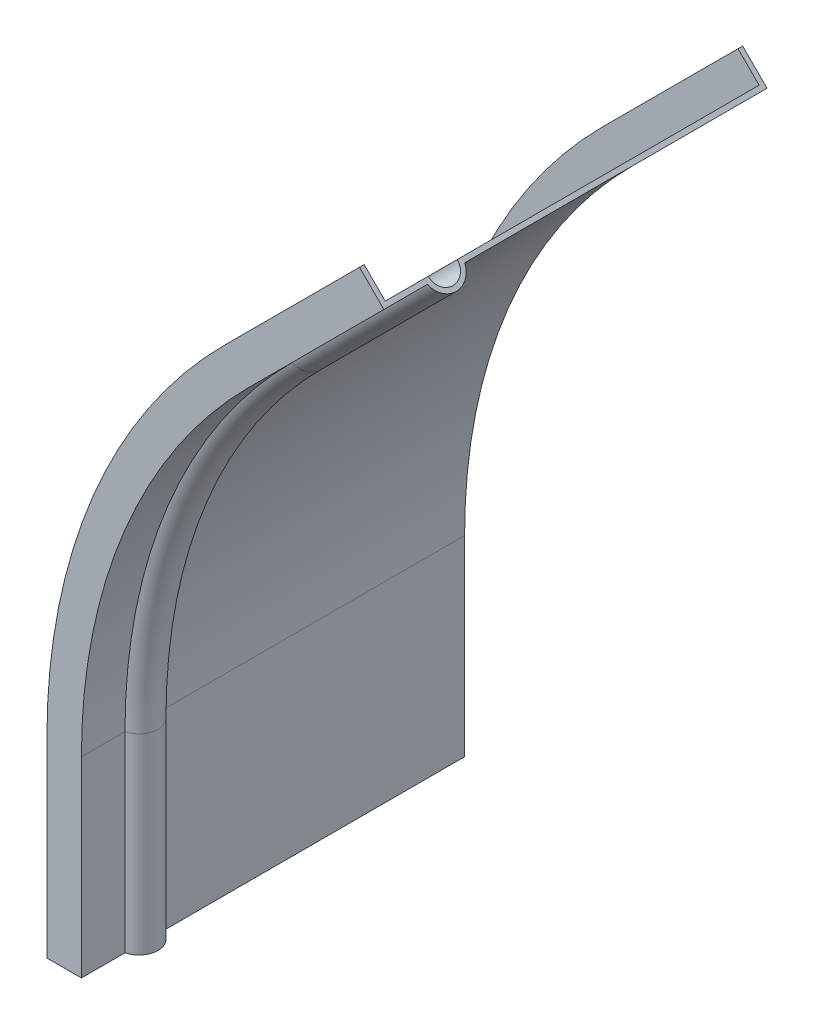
ISO-10303-21;
HEADER;
FILE_DESCRIPTION(('STEP AP214'),'2;1');
FILE_NAME('part.step','',(''),(''),'','','');
FILE_SCHEMA(('AUTOMOTIVE_DESIGN { 1 0 10303 214 1 1 1 1 }'));
ENDSEC;
DATA;
#1=APPLICATION_CONTEXT('core data for automotive mechanical design processes');
#2=APPLICATION_PROTOCOL_DEFINITION('international standard','automotive_design',2000,#1);
#3=PRODUCT_CONTEXT('',#1,'mechanical');
#4=PRODUCT('Part','Part','',(#3));
#5=PRODUCT_RELATED_PRODUCT_CATEGORY('part','',(#4));
#6=PRODUCT_DEFINITION_FORMATION('','',#4);
#7=PRODUCT_DEFINITION_CONTEXT('part definition',#1,'design');
#8=PRODUCT_DEFINITION('design','',#6,#7);
#9=PRODUCT_DEFINITION_SHAPE('','',#8);
#10=(LENGTH_UNIT() NAMED_UNIT(*) SI_UNIT(.MILLI.,.METRE.));
#11=(NAMED_UNIT(*) PLANE_ANGLE_UNIT() SI_UNIT($,.RADIAN.));
#12=(NAMED_UNIT(*) SI_UNIT($,.STERADIAN.) SOLID_ANGLE_UNIT());
#13=UNCERTAINTY_MEASURE_WITH_UNIT(LENGTH_MEASURE(1.E-05),#10,'distance_accuracy_value','');
#14=(GEOMETRIC_REPRESENTATION_CONTEXT(3) GLOBAL_UNCERTAINTY_ASSIGNED_CONTEXT((#13)) GLOBAL_UNIT_ASSIGNED_CONTEXT((#10,
#11,#12)) REPRESENTATION_CONTEXT('',''));
#15=CARTESIAN_POINT('',(0.,0.,0.));
#16=DIRECTION('',(0.,0.,1.));
#17=DIRECTION('',(1.,0.,0.));
#18=AXIS2_PLACEMENT_3D('',#15,#16,#17);
#19=CARTESIAN_POINT('',(538.428449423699,161.5715505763,0.));
#20=DIRECTION('',(-0.707106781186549,0.707106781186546,0.));
#21=DIRECTION('',(-0.707106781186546,-0.707106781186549,0.));
#22=AXIS2_PLACEMENT_3D('',#19,#20,#21);
#23=PLANE('',#22);
#24=DIRECTION('',(0.,0.,1.));
#25=VECTOR('',#24,1.);
#26=CARTESIAN_POINT('',(538.428449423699,161.5715505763,0.));
#27=LINE('',#26,#25);
#28=CARTESIAN_POINT('',(538.428449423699,161.5715505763,-1.21400000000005));
#29=VERTEX_POINT('',#28);
#30=CARTESIAN_POINT('',(538.428449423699,161.5715505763,0.));
#31=VERTEX_POINT('',#30);
#32=EDGE_CURVE('E243',#29,#31,#27,.T.);
#33=ORIENTED_EDGE('',*,*,#32,.T.);
#34=DIRECTION('',(0.707106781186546,0.707106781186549,0.));
#35=VECTOR('',#34,1.);
#36=CARTESIAN_POINT('',(538.428449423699,161.5715505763,0.));
#37=LINE('',#36,#35);
#38=CARTESIAN_POINT('',(573.783788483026,196.926889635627,0.));
#39=VERTEX_POINT('',#38);
#40=EDGE_CURVE('E333',#31,#39,#37,.T.);
#41=ORIENTED_EDGE('',*,*,#40,.T.);
#42=DIRECTION('',(0.,0.,1.));
#43=VECTOR('',#42,1.);
#44=CARTESIAN_POINT('',(573.783788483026,196.926889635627,0.));
#45=LINE('',#44,#43);
#46=CARTESIAN_POINT('',(573.783788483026,196.926889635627,-1.21400000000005));
#47=VERTEX_POINT('',#46);
#48=EDGE_CURVE('E52',#47,#39,#45,.T.);
#49=ORIENTED_EDGE('',*,*,#48,.F.);
#50=DIRECTION('',(0.707106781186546,0.707106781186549,0.));
#51=VECTOR('',#50,1.);
#52=CARTESIAN_POINT('',(538.428449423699,161.5715505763,-1.21400000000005));
#53=LINE('',#52,#51);
#54=EDGE_CURVE('E37',#29,#47,#53,.T.);
#55=ORIENTED_EDGE('',*,*,#54,.F.);
#56=EDGE_LOOP('',(#33,#41,#49,#55));
#57=FACE_BOUND('',#56,.T.);
#58=ADVANCED_FACE('F30',(#57),#23,.T.);
#59=CARTESIAN_POINT('',(543.933982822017,156.066017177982,78.786));
#60=DIRECTION('',(-0.707106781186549,0.707106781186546,0.));
#61=DIRECTION('',(-0.707106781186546,-0.707106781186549,0.));
#62=AXIS2_PLACEMENT_3D('',#59,#60,#61);
#63=PLANE('',#62);
#64=DIRECTION('',(0.,0.,1.));
#65=VECTOR('',#64,1.);
#66=CARTESIAN_POINT('',(543.933982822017,156.066017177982,78.786));
#67=LINE('',#66,#65);
#68=CARTESIAN_POINT('',(543.933982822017,156.066017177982,0.));
#69=VERTEX_POINT('',#68);
#70=CARTESIAN_POINT('',(543.933982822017,156.066017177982,78.786));
#71=VERTEX_POINT('',#70);
#72=EDGE_CURVE('E240',#69,#71,#67,.T.);
#73=ORIENTED_EDGE('',*,*,#72,.T.);
#74=DIRECTION('',(0.707106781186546,0.707106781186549,0.));
#75=VECTOR('',#74,1.);
#76=CARTESIAN_POINT('',(543.933982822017,156.066017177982,78.786));
#77=LINE('',#76,#75);
#78=CARTESIAN_POINT('',(579.289321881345,191.421356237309,78.786));
#79=VERTEX_POINT('',#78);
#80=EDGE_CURVE('E327',#71,#79,#77,.T.);
#81=ORIENTED_EDGE('',*,*,#80,.T.);
#82=DIRECTION('',(0.,0.,1.));
#83=VECTOR('',#82,1.);
#84=CARTESIAN_POINT('',(579.289321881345,191.421356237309,78.786));
#85=LINE('',#84,#83);
#86=CARTESIAN_POINT('',(579.289321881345,191.421356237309,0.));
#87=VERTEX_POINT('',#86);
#88=EDGE_CURVE('E298',#87,#79,#85,.T.);
#89=ORIENTED_EDGE('',*,*,#88,.F.);
#90=DIRECTION('',(0.707106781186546,0.707106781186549,0.));
#91=VECTOR('',#90,1.);
#92=CARTESIAN_POINT('',(543.933982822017,156.066017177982,0.));
#93=LINE('',#92,#91);
#94=EDGE_CURVE('E330',#69,#87,#93,.T.);
#95=ORIENTED_EDGE('',*,*,#94,.F.);
#96=EDGE_LOOP('',(#73,#81,#89,#95));
#97=FACE_BOUND('',#96,.T.);
#98=ADVANCED_FACE('F472',(#97),#63,.T.);
#99=CARTESIAN_POINT('',(543.933982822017,156.066017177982,82.572));
#100=DIRECTION('',(0.707106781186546,0.707106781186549,0.));
#101=DIRECTION('',(-0.707106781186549,0.707106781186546,0.));
#102=AXIS2_PLACEMENT_3D('',#99,#100,#101);
#103=CYLINDRICAL_SURFACE('',#102,3.786);
#104=CARTESIAN_POINT('',(543.933982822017,156.066017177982,82.572));
#105=DIRECTION('',(-0.707106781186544,-0.707106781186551,0.));
#106=DIRECTION('',(0.,0.,1.));
#107=AXIS2_PLACEMENT_3D('',#104,#105,#106);
#108=CIRCLE('',#107,3.786);
#109=CARTESIAN_POINT('',(543.933982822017,156.066017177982,86.358));
#110=VERTEX_POINT('',#109);
#111=EDGE_CURVE('E237',#71,#110,#108,.T.);
#112=ORIENTED_EDGE('',*,*,#111,.T.);
#113=DIRECTION('',(0.707106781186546,0.707106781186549,0.));
#114=VECTOR('',#113,1.);
#115=CARTESIAN_POINT('',(543.933982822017,156.066017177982,86.358));
#116=LINE('',#115,#114);
#117=CARTESIAN_POINT('',(579.289321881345,191.421356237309,86.358));
#118=VERTEX_POINT('',#117);
#119=EDGE_CURVE('E324',#110,#118,#116,.T.);
#120=ORIENTED_EDGE('',*,*,#119,.T.);
#121=CARTESIAN_POINT('',(579.289321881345,191.421356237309,82.572));
#122=DIRECTION('',(-0.707106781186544,-0.707106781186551,0.));
#123=DIRECTION('',(0.,0.,1.));
#124=AXIS2_PLACEMENT_3D('',#121,#122,#123);
#125=CIRCLE('',#124,3.786);
#126=EDGE_CURVE('E295',#79,#118,#125,.T.);
#127=ORIENTED_EDGE('',*,*,#126,.F.);
#128=ORIENTED_EDGE('',*,*,#80,.F.);
#129=EDGE_LOOP('',(#112,#120,#127,#128));
#130=FACE_BOUND('',#129,.T.);
#131=ADVANCED_FACE('F474',(#130),#103,.F.);
#132=CARTESIAN_POINT('',(543.933982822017,156.066017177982,97.572));
#133=DIRECTION('',(-0.707106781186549,0.707106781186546,0.));
#134=DIRECTION('',(-0.707106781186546,-0.707106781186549,0.));
#135=AXIS2_PLACEMENT_3D('',#132,#133,#134);
#136=PLANE('',#135);
#137=DIRECTION('',(0.,0.,1.));
#138=VECTOR('',#137,1.);
#139=CARTESIAN_POINT('',(543.933982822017,156.066017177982,97.572));
#140=LINE('',#139,#138);
#141=CARTESIAN_POINT('',(543.933982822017,156.066017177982,97.572));
#142=VERTEX_POINT('',#141);
#143=EDGE_CURVE('E234',#110,#142,#140,.T.);
#144=ORIENTED_EDGE('',*,*,#143,.T.);
#145=DIRECTION('',(0.707106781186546,0.707106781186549,0.));
#146=VECTOR('',#145,1.);
#147=CARTESIAN_POINT('',(543.933982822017,156.066017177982,97.572));
#148=LINE('',#147,#146);
#149=CARTESIAN_POINT('',(579.289321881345,191.421356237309,97.572));
#150=VERTEX_POINT('',#149);
#151=EDGE_CURVE('E321',#142,#150,#148,.T.);
#152=ORIENTED_EDGE('',*,*,#151,.T.);
#153=DIRECTION('',(0.,0.,1.));
#154=VECTOR('',#153,1.);
#155=CARTESIAN_POINT('',(579.289321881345,191.421356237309,97.572));
#156=LINE('',#155,#154);
#157=EDGE_CURVE('E292',#118,#150,#156,.T.);
#158=ORIENTED_EDGE('',*,*,#157,.F.);
#159=ORIENTED_EDGE('',*,*,#119,.F.);
#160=EDGE_LOOP('',(#144,#152,#158,#159));
#161=FACE_BOUND('',#160,.T.);
#162=ADVANCED_FACE('F477',(#161),#136,.T.);
#163=CARTESIAN_POINT('',(538.428449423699,161.5715505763,98.786));
#164=DIRECTION('',(-0.707106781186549,0.707106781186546,0.));
#165=DIRECTION('',(-0.707106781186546,-0.707106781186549,0.));
#166=AXIS2_PLACEMENT_3D('',#163,#164,#165);
#167=PLANE('',#166);
#168=DIRECTION('',(0.,0.,1.));
#169=VECTOR('',#168,1.);
#170=CARTESIAN_POINT('',(538.428449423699,161.5715505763,98.786));
#171=LINE('',#170,#169);
#172=CARTESIAN_POINT('',(538.428449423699,161.5715505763,97.572));
#173=VERTEX_POINT('',#172);
#174=CARTESIAN_POINT('',(538.428449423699,161.5715505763,98.786));
#175=VERTEX_POINT('',#174);
#176=EDGE_CURVE('E231',#173,#175,#171,.T.);
#177=ORIENTED_EDGE('',*,*,#176,.T.);
#178=DIRECTION('',(0.707106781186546,0.707106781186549,0.));
#179=VECTOR('',#178,1.);
#180=CARTESIAN_POINT('',(538.428449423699,161.5715505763,98.786));
#181=LINE('',#180,#179);
#182=CARTESIAN_POINT('',(573.783788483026,196.926889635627,98.786));
#183=VERTEX_POINT('',#182);
#184=EDGE_CURVE('E315',#175,#183,#181,.T.);
#185=ORIENTED_EDGE('',*,*,#184,.T.);
#186=DIRECTION('',(0.,0.,1.));
#187=VECTOR('',#186,1.);
#188=CARTESIAN_POINT('',(573.783788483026,196.926889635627,98.786));
#189=LINE('',#188,#187);
#190=CARTESIAN_POINT('',(573.783788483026,196.926889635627,97.572));
#191=VERTEX_POINT('',#190);
#192=EDGE_CURVE('E286',#191,#183,#189,.T.);
#193=ORIENTED_EDGE('',*,*,#192,.F.);
#194=DIRECTION('',(0.707106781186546,0.707106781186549,0.));
#195=VECTOR('',#194,1.);
#196=CARTESIAN_POINT('',(538.428449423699,161.5715505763,97.572));
#197=LINE('',#196,#195);
#198=EDGE_CURVE('E318',#173,#191,#197,.T.);
#199=ORIENTED_EDGE('',*,*,#198,.F.);
#200=EDGE_LOOP('',(#177,#185,#193,#199));
#201=FACE_BOUND('',#200,.T.);
#202=ADVANCED_FACE('F479',(#201),#167,.T.);
#203=CARTESIAN_POINT('',(544.792410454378,155.207589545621,87.4223818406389));
#204=DIRECTION('',(0.707106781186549,-0.707106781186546,0.));
#205=DIRECTION('',(0.707106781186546,0.707106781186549,0.));
#206=AXIS2_PLACEMENT_3D('',#203,#204,#205);
#207=PLANE('',#206);
#208=DIRECTION('',(0.,0.,-1.));
#209=VECTOR('',#208,1.);
#210=CARTESIAN_POINT('',(544.792410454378,155.207589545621,87.4223818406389));
#211=LINE('',#210,#209);
#212=CARTESIAN_POINT('',(544.792410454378,155.207589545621,98.786));
#213=VERTEX_POINT('',#212);
#214=CARTESIAN_POINT('',(544.792410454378,155.207589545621,87.4223818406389));
#215=VERTEX_POINT('',#214);
#216=EDGE_CURVE('E228',#213,#215,#211,.T.);
#217=ORIENTED_EDGE('',*,*,#216,.T.);
#218=DIRECTION('',(0.707106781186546,0.707106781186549,0.));
#219=VECTOR('',#218,1.);
#220=CARTESIAN_POINT('',(544.792410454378,155.207589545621,87.4223818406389));
#221=LINE('',#220,#219);
#222=CARTESIAN_POINT('',(580.147749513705,190.562928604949,87.4223818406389));
#223=VERTEX_POINT('',#222);
#224=EDGE_CURVE('E309',#215,#223,#221,.T.);
#225=ORIENTED_EDGE('',*,*,#224,.T.);
#226=DIRECTION('',(0.,0.,-1.));
#227=VECTOR('',#226,1.);
#228=CARTESIAN_POINT('',(580.147749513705,190.562928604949,87.4223818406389));
#229=LINE('',#228,#227);
#230=CARTESIAN_POINT('',(580.147749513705,190.562928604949,98.786));
#231=VERTEX_POINT('',#230);
#232=EDGE_CURVE('E280',#231,#223,#229,.T.);
#233=ORIENTED_EDGE('',*,*,#232,.F.);
#234=DIRECTION('',(0.707106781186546,0.707106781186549,0.));
#235=VECTOR('',#234,1.);
#236=CARTESIAN_POINT('',(544.792410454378,155.207589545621,98.786));
#237=LINE('',#236,#235);
#238=EDGE_CURVE('E312',#213,#231,#237,.T.);
#239=ORIENTED_EDGE('',*,*,#238,.F.);
#240=EDGE_LOOP('',(#217,#225,#233,#239));
#241=FACE_BOUND('',#240,.T.);
#242=ADVANCED_FACE('F482',(#241),#207,.T.);
#243=CARTESIAN_POINT('',(543.933982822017,156.066017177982,82.572));
#244=DIRECTION('',(0.707106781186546,0.707106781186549,0.));
#245=DIRECTION('',(-0.707106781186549,0.707106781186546,0.));
#246=AXIS2_PLACEMENT_3D('',#243,#244,#245);
#247=CYLINDRICAL_SURFACE('',#246,5.);
#248=CARTESIAN_POINT('',(543.933982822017,156.066017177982,82.572));
#249=DIRECTION('',(0.707106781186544,0.707106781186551,0.));
#250=DIRECTION('',(0.,0.,-1.));
#251=AXIS2_PLACEMENT_3D('',#248,#249,#250);
#252=CIRCLE('',#251,5.);
#253=CARTESIAN_POINT('',(544.792410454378,155.207589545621,77.7216181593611));
#254=VERTEX_POINT('',#253);
#255=EDGE_CURVE('E219',#215,#254,#252,.T.);
#256=ORIENTED_EDGE('',*,*,#255,.T.);
#257=DIRECTION('',(0.707106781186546,0.707106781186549,0.));
#258=VECTOR('',#257,1.);
#259=CARTESIAN_POINT('',(544.792410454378,155.207589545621,77.7216181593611));
#260=LINE('',#259,#258);
#261=CARTESIAN_POINT('',(580.147749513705,190.562928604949,77.7216181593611));
#262=VERTEX_POINT('',#261);
#263=EDGE_CURVE('E306',#254,#262,#260,.T.);
#264=ORIENTED_EDGE('',*,*,#263,.T.);
#265=CARTESIAN_POINT('',(579.289321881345,191.421356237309,82.572));
#266=DIRECTION('',(0.707106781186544,0.707106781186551,0.));
#267=DIRECTION('',(0.,0.,-1.));
#268=AXIS2_PLACEMENT_3D('',#265,#266,#267);
#269=CIRCLE('',#268,5.);
#270=EDGE_CURVE('E277',#223,#262,#269,.T.);
#271=ORIENTED_EDGE('',*,*,#270,.F.);
#272=ORIENTED_EDGE('',*,*,#224,.F.);
#273=EDGE_LOOP('',(#256,#264,#271,#272));
#274=FACE_BOUND('',#273,.T.);
#275=ADVANCED_FACE('F484',(#274),#247,.T.);
#276=CARTESIAN_POINT('',(544.792410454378,155.207589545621,-1.21400000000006));
#277=DIRECTION('',(0.707106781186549,-0.707106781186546,0.));
#278=DIRECTION('',(0.707106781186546,0.707106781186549,0.));
#279=AXIS2_PLACEMENT_3D('',#276,#277,#278);
#280=PLANE('',#279);
#281=DIRECTION('',(0.,0.,-1.));
#282=VECTOR('',#281,1.);
#283=CARTESIAN_POINT('',(544.792410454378,155.207589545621,-1.21400000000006));
#284=LINE('',#283,#282);
#285=CARTESIAN_POINT('',(544.792410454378,155.207589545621,-1.21400000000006));
#286=VERTEX_POINT('',#285);
#287=EDGE_CURVE('E216',#254,#286,#284,.T.);
#288=ORIENTED_EDGE('',*,*,#287,.T.);
#289=DIRECTION('',(0.707106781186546,0.707106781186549,0.));
#290=VECTOR('',#289,1.);
#291=CARTESIAN_POINT('',(544.792410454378,155.207589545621,-1.21400000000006));
#292=LINE('',#291,#290);
#293=CARTESIAN_POINT('',(580.147749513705,190.562928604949,-1.21400000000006));
#294=VERTEX_POINT('',#293);
#295=EDGE_CURVE('E11',#286,#294,#292,.T.);
#296=ORIENTED_EDGE('',*,*,#295,.T.);
#297=DIRECTION('',(0.,0.,-1.));
#298=VECTOR('',#297,1.);
#299=CARTESIAN_POINT('',(580.147749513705,190.562928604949,-1.21400000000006));
#300=LINE('',#299,#298);
#301=EDGE_CURVE('E199',#262,#294,#300,.T.);
#302=ORIENTED_EDGE('',*,*,#301,.F.);
#303=ORIENTED_EDGE('',*,*,#263,.F.);
#304=EDGE_LOOP('',(#288,#296,#302,#303));
#305=FACE_BOUND('',#304,.T.);
#306=ADVANCED_FACE('F348',(#305),#280,.T.);
#307=CARTESIAN_POINT('',(650.,50.,0.));
#308=DIRECTION('',(0.,0.,-1.));
#309=DIRECTION('',(-1.,0.,0.));
#310=AXIS2_PLACEMENT_3D('',#307,#308,#309);
#311=CYLINDRICAL_SURFACE('',#310,157.786);
#312=DIRECTION('',(0.,0.,1.));
#313=VECTOR('',#312,1.);
#314=CARTESIAN_POINT('',(492.214,50.,0.));
#315=LINE('',#314,#313);
#316=CARTESIAN_POINT('',(492.214,50.,-1.21400000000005));
#317=VERTEX_POINT('',#316);
#318=CARTESIAN_POINT('',(492.214,50.,0.));
#319=VERTEX_POINT('',#318);
#320=EDGE_CURVE('E210',#317,#319,#315,.T.);
#321=ORIENTED_EDGE('',*,*,#320,.T.);
#322=CARTESIAN_POINT('',(650.,50.,0.));
#323=DIRECTION('',(0.,0.,-1.));
#324=DIRECTION('',(-1.,0.,0.));
#325=AXIS2_PLACEMENT_3D('',#322,#323,#324);
#326=CIRCLE('',#325,157.786);
#327=EDGE_CURVE('E271',#319,#31,#326,.T.);
#328=ORIENTED_EDGE('',*,*,#327,.T.);
#329=ORIENTED_EDGE('',*,*,#32,.F.);
#330=CARTESIAN_POINT('',(650.,50.,-1.21400000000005));
#331=DIRECTION('',(0.,0.,-1.));
#332=DIRECTION('',(-1.,0.,0.));
#333=AXIS2_PLACEMENT_3D('',#330,#331,#332);
#334=CIRCLE('',#333,157.786);
#335=EDGE_CURVE('E200',#317,#29,#334,.T.);
#336=ORIENTED_EDGE('',*,*,#335,.F.);
#337=EDGE_LOOP('',(#321,#328,#329,#336));
#338=FACE_BOUND('',#337,.T.);
#339=ADVANCED_FACE('F338',(#338),#311,.T.);
#340=CARTESIAN_POINT('',(650.,50.,0.));
#341=DIRECTION('',(0.,0.,-1.));
#342=DIRECTION('',(-1.,0.,0.));
#343=AXIS2_PLACEMENT_3D('',#340,#341,#342);
#344=CYLINDRICAL_SURFACE('',#343,150.);
#345=DIRECTION('',(0.,0.,1.));
#346=VECTOR('',#345,1.);
#347=CARTESIAN_POINT('',(500.,50.,78.786));
#348=LINE('',#347,#346);
#349=CARTESIAN_POINT('',(500.,50.,0.));
#350=VERTEX_POINT('',#349);
#351=CARTESIAN_POINT('',(500.,50.,78.786));
#352=VERTEX_POINT('',#351);
#353=EDGE_CURVE('E397',#350,#352,#348,.T.);
#354=ORIENTED_EDGE('',*,*,#353,.T.);
#355=CARTESIAN_POINT('',(650.,50.,78.786));
#356=DIRECTION('',(0.,0.,-1.));
#357=DIRECTION('',(-1.,0.,0.));
#358=AXIS2_PLACEMENT_3D('',#355,#356,#357);
#359=CIRCLE('',#358,150.);
#360=EDGE_CURVE('E265',#352,#71,#359,.T.);
#361=ORIENTED_EDGE('',*,*,#360,.T.);
#362=ORIENTED_EDGE('',*,*,#72,.F.);
#363=CARTESIAN_POINT('',(650.,50.,0.));
#364=DIRECTION('',(0.,0.,-1.));
#365=DIRECTION('',(-1.,0.,0.));
#366=AXIS2_PLACEMENT_3D('',#363,#364,#365);
#367=CIRCLE('',#366,150.);
#368=EDGE_CURVE('E268',#350,#69,#367,.T.);
#369=ORIENTED_EDGE('',*,*,#368,.F.);
#370=EDGE_LOOP('',(#354,#361,#362,#369));
#371=FACE_BOUND('',#370,.T.);
#372=ADVANCED_FACE('F470',(#371),#344,.T.);
#373=CARTESIAN_POINT('',(650.,50.,82.572));
#374=DIRECTION('',(0.,0.,-1.));
#375=DIRECTION('',(-1.,0.,0.));
#376=AXIS2_PLACEMENT_3D('',#373,#374,#375);
#377=TOROIDAL_SURFACE('',#376,150.,3.786);
#378=CARTESIAN_POINT('',(500.,50.,82.572));
#379=DIRECTION('',(0.,-1.,0.));
#380=DIRECTION('',(0.,0.,1.));
#381=AXIS2_PLACEMENT_3D('',#378,#379,#380);
#382=CIRCLE('',#381,3.786);
#383=CARTESIAN_POINT('',(500.,50.,86.358));
#384=VERTEX_POINT('',#383);
#385=EDGE_CURVE('E433',#352,#384,#382,.T.);
#386=ORIENTED_EDGE('',*,*,#385,.T.);
#387=CARTESIAN_POINT('',(650.,50.,86.358));
#388=DIRECTION('',(0.,0.,-1.));
#389=DIRECTION('',(-1.,0.,0.));
#390=AXIS2_PLACEMENT_3D('',#387,#388,#389);
#391=CIRCLE('',#390,150.);
#392=EDGE_CURVE('E262',#384,#110,#391,.T.);
#393=ORIENTED_EDGE('',*,*,#392,.T.);
#394=ORIENTED_EDGE('',*,*,#111,.F.);
#395=ORIENTED_EDGE('',*,*,#360,.F.);
#396=EDGE_LOOP('',(#386,#393,#394,#395));
#397=FACE_BOUND('',#396,.T.);
#398=ADVANCED_FACE('F466',(#397),#377,.F.);
#399=CARTESIAN_POINT('',(650.,50.,0.));
#400=DIRECTION('',(0.,0.,-1.));
#401=DIRECTION('',(-1.,0.,0.));
#402=AXIS2_PLACEMENT_3D('',#399,#400,#401);
#403=CYLINDRICAL_SURFACE('',#402,150.);
#404=DIRECTION('',(0.,0.,1.));
#405=VECTOR('',#404,1.);
#406=CARTESIAN_POINT('',(500.,50.,97.572));
#407=LINE('',#406,#405);
#408=CARTESIAN_POINT('',(500.,50.,97.572));
#409=VERTEX_POINT('',#408);
#410=EDGE_CURVE('E438',#384,#409,#407,.T.);
#411=ORIENTED_EDGE('',*,*,#410,.T.);
#412=CARTESIAN_POINT('',(650.,50.,97.572));
#413=DIRECTION('',(0.,0.,-1.));
#414=DIRECTION('',(-1.,0.,0.));
#415=AXIS2_PLACEMENT_3D('',#412,#413,#414);
#416=CIRCLE('',#415,150.);
#417=EDGE_CURVE('E259',#409,#142,#416,.T.);
#418=ORIENTED_EDGE('',*,*,#417,.T.);
#419=ORIENTED_EDGE('',*,*,#143,.F.);
#420=ORIENTED_EDGE('',*,*,#392,.F.);
#421=EDGE_LOOP('',(#411,#418,#419,#420));
#422=FACE_BOUND('',#421,.T.);
#423=ADVANCED_FACE('F548',(#422),#403,.T.);
#424=CARTESIAN_POINT('',(650.,50.,0.));
#425=DIRECTION('',(0.,0.,-1.));
#426=DIRECTION('',(-1.,0.,0.));
#427=AXIS2_PLACEMENT_3D('',#424,#425,#426);
#428=CYLINDRICAL_SURFACE('',#427,157.786);
#429=DIRECTION('',(0.,0.,1.));
#430=VECTOR('',#429,1.);
#431=CARTESIAN_POINT('',(492.214,50.,98.786));
#432=LINE('',#431,#430);
#433=CARTESIAN_POINT('',(492.214,50.,97.572));
#434=VERTEX_POINT('',#433);
#435=CARTESIAN_POINT('',(492.214,50.,98.786));
#436=VERTEX_POINT('',#435);
#437=EDGE_CURVE('E441',#434,#436,#432,.T.);
#438=ORIENTED_EDGE('',*,*,#437,.T.);
#439=CARTESIAN_POINT('',(650.,50.,98.786));
#440=DIRECTION('',(0.,0.,-1.));
#441=DIRECTION('',(-1.,0.,0.));
#442=AXIS2_PLACEMENT_3D('',#439,#440,#441);
#443=CIRCLE('',#442,157.786);
#444=EDGE_CURVE('E253',#436,#175,#443,.T.);
#445=ORIENTED_EDGE('',*,*,#444,.T.);
#446=ORIENTED_EDGE('',*,*,#176,.F.);
#447=CARTESIAN_POINT('',(650.,50.,97.572));
#448=DIRECTION('',(0.,0.,-1.));
#449=DIRECTION('',(-1.,0.,0.));
#450=AXIS2_PLACEMENT_3D('',#447,#448,#449);
#451=CIRCLE('',#450,157.786);
#452=EDGE_CURVE('E256',#434,#173,#451,.T.);
#453=ORIENTED_EDGE('',*,*,#452,.F.);
#454=EDGE_LOOP('',(#438,#445,#446,#453));
#455=FACE_BOUND('',#454,.T.);
#456=ADVANCED_FACE('F557',(#455),#428,.T.);
#457=CARTESIAN_POINT('',(650.,50.,0.));
#458=DIRECTION('',(0.,0.,-1.));
#459=DIRECTION('',(-1.,0.,0.));
#460=AXIS2_PLACEMENT_3D('',#457,#458,#459);
#461=CYLINDRICAL_SURFACE('',#460,148.786);
#462=DIRECTION('',(0.,0.,-1.));
#463=VECTOR('',#462,1.);
#464=CARTESIAN_POINT('',(501.214,50.,87.4223818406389));
#465=LINE('',#464,#463);
#466=CARTESIAN_POINT('',(501.214,50.,98.786));
#467=VERTEX_POINT('',#466);
#468=CARTESIAN_POINT('',(501.214,50.,87.4223818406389));
#469=VERTEX_POINT('',#468);
#470=EDGE_CURVE('E359',#467,#469,#465,.T.);
#471=ORIENTED_EDGE('',*,*,#470,.T.);
#472=CARTESIAN_POINT('',(650.,50.,87.4223818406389));
#473=DIRECTION('',(0.,0.,-1.));
#474=DIRECTION('',(-1.,0.,0.));
#475=AXIS2_PLACEMENT_3D('',#472,#473,#474);
#476=CIRCLE('',#475,148.786);
#477=EDGE_CURVE('E247',#469,#215,#476,.T.);
#478=ORIENTED_EDGE('',*,*,#477,.T.);
#479=ORIENTED_EDGE('',*,*,#216,.F.);
#480=CARTESIAN_POINT('',(650.,50.,98.786));
#481=DIRECTION('',(0.,0.,-1.));
#482=DIRECTION('',(-1.,0.,0.));
#483=AXIS2_PLACEMENT_3D('',#480,#481,#482);
#484=CIRCLE('',#483,148.786);
#485=EDGE_CURVE('E250',#467,#213,#484,.T.);
#486=ORIENTED_EDGE('',*,*,#485,.F.);
#487=EDGE_LOOP('',(#471,#478,#479,#486));
#488=FACE_BOUND('',#487,.T.);
#489=ADVANCED_FACE('F444',(#488),#461,.F.);
#490=CARTESIAN_POINT('',(650.,50.,82.572));
#491=DIRECTION('',(0.,0.,-1.));
#492=DIRECTION('',(-1.,0.,0.));
#493=AXIS2_PLACEMENT_3D('',#490,#491,#492);
#494=TOROIDAL_SURFACE('',#493,150.,5.);
#495=CARTESIAN_POINT('',(500.,50.,82.572));
#496=DIRECTION('',(0.,1.,0.));
#497=DIRECTION('',(0.,0.,-1.));
#498=AXIS2_PLACEMENT_3D('',#495,#496,#497);
#499=CIRCLE('',#498,5.);
#500=CARTESIAN_POINT('',(501.214,50.,77.7216181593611));
#501=VERTEX_POINT('',#500);
#502=EDGE_CURVE('E353',#469,#501,#499,.T.);
#503=ORIENTED_EDGE('',*,*,#502,.T.);
#504=CARTESIAN_POINT('',(650.,50.,77.7216181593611));
#505=DIRECTION('',(0.,0.,-1.));
#506=DIRECTION('',(-1.,0.,0.));
#507=AXIS2_PLACEMENT_3D('',#504,#505,#506);
#508=CIRCLE('',#507,148.786);
#509=EDGE_CURVE('E206',#501,#254,#508,.T.);
#510=ORIENTED_EDGE('',*,*,#509,.T.);
#511=ORIENTED_EDGE('',*,*,#255,.F.);
#512=ORIENTED_EDGE('',*,*,#477,.F.);
#513=EDGE_LOOP('',(#503,#510,#511,#512));
#514=FACE_BOUND('',#513,.T.);
#515=ADVANCED_FACE('F351',(#514),#494,.T.);
#516=CARTESIAN_POINT('',(650.,50.,0.));
#517=DIRECTION('',(0.,0.,-1.));
#518=DIRECTION('',(-1.,0.,0.));
#519=AXIS2_PLACEMENT_3D('',#516,#517,#518);
#520=CYLINDRICAL_SURFACE('',#519,148.786);
#521=DIRECTION('',(0.,0.,-1.));
#522=VECTOR('',#521,1.);
#523=CARTESIAN_POINT('',(501.214,50.,-1.21400000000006));
#524=LINE('',#523,#522);
#525=CARTESIAN_POINT('',(501.214,50.,-1.21400000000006));
#526=VERTEX_POINT('',#525);
#527=EDGE_CURVE('E203',#501,#526,#524,.T.);
#528=ORIENTED_EDGE('',*,*,#527,.T.);
#529=CARTESIAN_POINT('',(650.,50.,-1.21400000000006));
#530=DIRECTION('',(0.,0.,-1.));
#531=DIRECTION('',(-1.,0.,0.));
#532=AXIS2_PLACEMENT_3D('',#529,#530,#531);
#533=CIRCLE('',#532,148.786);
#534=EDGE_CURVE('E190',#526,#286,#533,.T.);
#535=ORIENTED_EDGE('',*,*,#534,.T.);
#536=ORIENTED_EDGE('',*,*,#287,.F.);
#537=ORIENTED_EDGE('',*,*,#509,.F.);
#538=EDGE_LOOP('',(#528,#535,#536,#537));
#539=FACE_BOUND('',#538,.T.);
#540=ADVANCED_FACE('F204',(#539),#520,.F.);
#541=CARTESIAN_POINT('',(501.214,50.,-1.21400000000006));
#542=DIRECTION('',(-1.,0.,0.));
#543=DIRECTION('',(0.,0.,1.));
#544=AXIS2_PLACEMENT_3D('',#541,#542,#543);
#545=PLANE('',#544);
#546=DIRECTION('',(0.,0.,-1.));
#547=VECTOR('',#546,1.);
#548=CARTESIAN_POINT('',(501.214,0.,-1.21400000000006));
#549=LINE('',#548,#547);
#550=CARTESIAN_POINT('',(501.214,0.,77.7216181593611));
#551=VERTEX_POINT('',#550);
#552=CARTESIAN_POINT('',(501.214,0.,-1.21400000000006));
#553=VERTEX_POINT('',#552);
#554=EDGE_CURVE('E215',#551,#553,#549,.T.);
#555=ORIENTED_EDGE('',*,*,#554,.T.);
#556=DIRECTION('',(0.,-1.,0.));
#557=VECTOR('',#556,1.);
#558=CARTESIAN_POINT('',(501.214,50.,-1.21400000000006));
#559=LINE('',#558,#557);
#560=EDGE_CURVE('E194',#526,#553,#559,.T.);
#561=ORIENTED_EDGE('',*,*,#560,.F.);
#562=ORIENTED_EDGE('',*,*,#527,.F.);
#563=DIRECTION('',(0.,-1.,0.));
#564=VECTOR('',#563,1.);
#565=CARTESIAN_POINT('',(501.214,50.,77.7216181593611));
#566=LINE('',#565,#564);
#567=EDGE_CURVE('E358',#501,#551,#566,.T.);
#568=ORIENTED_EDGE('',*,*,#567,.T.);
#569=EDGE_LOOP('',(#555,#561,#562,#568));
#570=FACE_BOUND('',#569,.T.);
#571=ADVANCED_FACE('F213',(#570),#545,.F.);
#572=CARTESIAN_POINT('',(501.214,50.,-1.21400000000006));
#573=DIRECTION('',(0.,0.,1.));
#574=DIRECTION('',(1.,0.,0.));
#575=AXIS2_PLACEMENT_3D('',#572,#573,#574);
#576=PLANE('',#575);
#577=DIRECTION('',(-1.,0.,0.));
#578=VECTOR('',#577,1.);
#579=CARTESIAN_POINT('',(501.214,0.,-1.21400000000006));
#580=LINE('',#579,#578);
#581=CARTESIAN_POINT('',(492.214,0.,-1.21400000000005));
#582=VERTEX_POINT('',#581);
#583=EDGE_CURVE('E426',#553,#582,#580,.T.);
#584=ORIENTED_EDGE('',*,*,#583,.T.);
#585=DIRECTION('',(0.,-1.,0.));
#586=VECTOR('',#585,1.);
#587=CARTESIAN_POINT('',(492.214,50.,-1.21400000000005));
#588=LINE('',#587,#586);
#589=EDGE_CURVE('E217',#317,#582,#588,.T.);
#590=ORIENTED_EDGE('',*,*,#589,.F.);
#591=ORIENTED_EDGE('',*,*,#335,.T.);
#592=ORIENTED_EDGE('',*,*,#54,.T.);
#593=DIRECTION('',(-0.707106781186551,0.707106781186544,0.));
#594=VECTOR('',#593,1.);
#595=CARTESIAN_POINT('',(580.147749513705,190.562928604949,-1.21400000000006));
#596=LINE('',#595,#594);
#597=EDGE_CURVE('E44',#294,#47,#596,.T.);
#598=ORIENTED_EDGE('',*,*,#597,.F.);
#599=ORIENTED_EDGE('',*,*,#295,.F.);
#600=ORIENTED_EDGE('',*,*,#534,.F.);
#601=ORIENTED_EDGE('',*,*,#560,.T.);
#602=EDGE_LOOP('',(#584,#590,#591,#592,#598,#599,#600,#601));
#603=FACE_BOUND('',#602,.T.);
#604=ADVANCED_FACE('F192',(#603),#576,.F.);
#605=CARTESIAN_POINT('',(492.214,50.,0.));
#606=DIRECTION('',(1.,0.,0.));
#607=DIRECTION('',(0.,0.,-1.));
#608=AXIS2_PLACEMENT_3D('',#605,#606,#607);
#609=PLANE('',#608);
#610=DIRECTION('',(0.,0.,1.));
#611=VECTOR('',#610,1.);
#612=CARTESIAN_POINT('',(492.214,0.,0.));
#613=LINE('',#612,#611);
#614=CARTESIAN_POINT('',(492.214,0.,0.));
#615=VERTEX_POINT('',#614);
#616=EDGE_CURVE('E408',#582,#615,#613,.T.);
#617=ORIENTED_EDGE('',*,*,#616,.T.);
#618=DIRECTION('',(0.,-1.,0.));
#619=VECTOR('',#618,1.);
#620=CARTESIAN_POINT('',(492.214,50.,0.));
#621=LINE('',#620,#619);
#622=EDGE_CURVE('E222',#319,#615,#621,.T.);
#623=ORIENTED_EDGE('',*,*,#622,.F.);
#624=ORIENTED_EDGE('',*,*,#320,.F.);
#625=ORIENTED_EDGE('',*,*,#589,.T.);
#626=EDGE_LOOP('',(#617,#623,#624,#625));
#627=FACE_BOUND('',#626,.T.);
#628=ADVANCED_FACE('F431',(#627),#609,.F.);
#629=CARTESIAN_POINT('',(500.,50.,0.));
#630=DIRECTION('',(0.,0.,-1.));
#631=DIRECTION('',(-1.,0.,0.));
#632=AXIS2_PLACEMENT_3D('',#629,#630,#631);
#633=PLANE('',#632);
#634=DIRECTION('',(1.,0.,0.));
#635=VECTOR('',#634,1.);
#636=CARTESIAN_POINT('',(500.,0.,0.));
#637=LINE('',#636,#635);
#638=CARTESIAN_POINT('',(500.,0.,0.));
#639=VERTEX_POINT('',#638);
#640=EDGE_CURVE('E402',#615,#639,#637,.T.);
#641=ORIENTED_EDGE('',*,*,#640,.T.);
#642=DIRECTION('',(0.,-1.,0.));
#643=VECTOR('',#642,1.);
#644=CARTESIAN_POINT('',(500.,50.,0.));
#645=LINE('',#644,#643);
#646=EDGE_CURVE('E387',#350,#639,#645,.T.);
#647=ORIENTED_EDGE('',*,*,#646,.F.);
#648=ORIENTED_EDGE('',*,*,#368,.T.);
#649=ORIENTED_EDGE('',*,*,#94,.T.);
#650=DIRECTION('',(0.707106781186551,-0.707106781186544,0.));
#651=VECTOR('',#650,1.);
#652=CARTESIAN_POINT('',(579.289321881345,191.421356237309,0.));
#653=LINE('',#652,#651);
#654=EDGE_CURVE('E301',#39,#87,#653,.T.);
#655=ORIENTED_EDGE('',*,*,#654,.F.);
#656=ORIENTED_EDGE('',*,*,#40,.F.);
#657=ORIENTED_EDGE('',*,*,#327,.F.);
#658=ORIENTED_EDGE('',*,*,#622,.T.);
#659=EDGE_LOOP('',(#641,#647,#648,#649,#655,#656,#657,#658));
#660=FACE_BOUND('',#659,.T.);
#661=ADVANCED_FACE('F343',(#660),#633,.F.);
#662=CARTESIAN_POINT('',(500.,50.,78.786));
#663=DIRECTION('',(1.,0.,0.));
#664=DIRECTION('',(0.,0.,-1.));
#665=AXIS2_PLACEMENT_3D('',#662,#663,#664);
#666=PLANE('',#665);
#667=DIRECTION('',(0.,0.,1.));
#668=VECTOR('',#667,1.);
#669=CARTESIAN_POINT('',(500.,0.,78.786));
#670=LINE('',#669,#668);
#671=CARTESIAN_POINT('',(500.,0.,78.786));
#672=VERTEX_POINT('',#671);
#673=EDGE_CURVE('E395',#639,#672,#670,.T.);
#674=ORIENTED_EDGE('',*,*,#673,.T.);
#675=DIRECTION('',(0.,-1.,0.));
#676=VECTOR('',#675,1.);
#677=CARTESIAN_POINT('',(500.,50.,78.786));
#678=LINE('',#677,#676);
#679=EDGE_CURVE('E384',#352,#672,#678,.T.);
#680=ORIENTED_EDGE('',*,*,#679,.F.);
#681=ORIENTED_EDGE('',*,*,#353,.F.);
#682=ORIENTED_EDGE('',*,*,#646,.T.);
#683=EDGE_LOOP('',(#674,#680,#681,#682));
#684=FACE_BOUND('',#683,.T.);
#685=ADVANCED_FACE('F393',(#684),#666,.F.);
#686=CARTESIAN_POINT('',(500.,50.,82.572));
#687=DIRECTION('',(0.,-1.,0.));
#688=DIRECTION('',(0.,0.,-1.));
#689=AXIS2_PLACEMENT_3D('',#686,#687,#688);
#690=CYLINDRICAL_SURFACE('',#689,3.786);
#691=CARTESIAN_POINT('',(500.,0.,82.572));
#692=DIRECTION('',(0.,-1.,0.));
#693=DIRECTION('',(0.,0.,1.));
#694=AXIS2_PLACEMENT_3D('',#691,#692,#693);
#695=CIRCLE('',#694,3.786);
#696=CARTESIAN_POINT('',(500.,0.,86.358));
#697=VERTEX_POINT('',#696);
#698=EDGE_CURVE('E404',#672,#697,#695,.T.);
#699=ORIENTED_EDGE('',*,*,#698,.T.);
#700=DIRECTION('',(0.,-1.,0.));
#701=VECTOR('',#700,1.);
#702=CARTESIAN_POINT('',(500.,50.,86.358));
#703=LINE('',#702,#701);
#704=EDGE_CURVE('E381',#384,#697,#703,.T.);
#705=ORIENTED_EDGE('',*,*,#704,.F.);
#706=ORIENTED_EDGE('',*,*,#385,.F.);
#707=ORIENTED_EDGE('',*,*,#679,.T.);
#708=EDGE_LOOP('',(#699,#705,#706,#707));
#709=FACE_BOUND('',#708,.T.);
#710=ADVANCED_FACE('F464',(#709),#690,.F.);
#711=CARTESIAN_POINT('',(500.,50.,97.572));
#712=DIRECTION('',(1.,0.,0.));
#713=DIRECTION('',(0.,0.,-1.));
#714=AXIS2_PLACEMENT_3D('',#711,#712,#713);
#715=PLANE('',#714);
#716=DIRECTION('',(0.,0.,1.));
#717=VECTOR('',#716,1.);
#718=CARTESIAN_POINT('',(500.,0.,97.572));
#719=LINE('',#718,#717);
#720=CARTESIAN_POINT('',(500.,0.,97.572));
#721=VERTEX_POINT('',#720);
#722=EDGE_CURVE('E406',#697,#721,#719,.T.);
#723=ORIENTED_EDGE('',*,*,#722,.T.);
#724=DIRECTION('',(0.,-1.,0.));
#725=VECTOR('',#724,1.);
#726=CARTESIAN_POINT('',(500.,50.,97.572));
#727=LINE('',#726,#725);
#728=EDGE_CURVE('E378',#409,#721,#727,.T.);
#729=ORIENTED_EDGE('',*,*,#728,.F.);
#730=ORIENTED_EDGE('',*,*,#410,.F.);
#731=ORIENTED_EDGE('',*,*,#704,.T.);
#732=EDGE_LOOP('',(#723,#729,#730,#731));
#733=FACE_BOUND('',#732,.T.);
#734=ADVANCED_FACE('F460',(#733),#715,.F.);
#735=CARTESIAN_POINT('',(492.214,50.,97.572));
#736=DIRECTION('',(0.,0.,1.));
#737=DIRECTION('',(1.,0.,0.));
#738=AXIS2_PLACEMENT_3D('',#735,#736,#737);
#739=PLANE('',#738);
#740=DIRECTION('',(-1.,0.,0.));
#741=VECTOR('',#740,1.);
#742=CARTESIAN_POINT('',(492.214,0.,97.572));
#743=LINE('',#742,#741);
#744=CARTESIAN_POINT('',(492.214,0.,97.572));
#745=VERTEX_POINT('',#744);
#746=EDGE_CURVE('E413',#721,#745,#743,.T.);
#747=ORIENTED_EDGE('',*,*,#746,.T.);
#748=DIRECTION('',(0.,-1.,0.));
#749=VECTOR('',#748,1.);
#750=CARTESIAN_POINT('',(492.214,50.,97.572));
#751=LINE('',#750,#749);
#752=EDGE_CURVE('E375',#434,#745,#751,.T.);
#753=ORIENTED_EDGE('',*,*,#752,.F.);
#754=ORIENTED_EDGE('',*,*,#452,.T.);
#755=ORIENTED_EDGE('',*,*,#198,.T.);
#756=DIRECTION('',(-0.707106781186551,0.707106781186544,0.));
#757=VECTOR('',#756,1.);
#758=CARTESIAN_POINT('',(573.783788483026,196.926889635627,97.572));
#759=LINE('',#758,#757);
#760=EDGE_CURVE('E289',#150,#191,#759,.T.);
#761=ORIENTED_EDGE('',*,*,#760,.F.);
#762=ORIENTED_EDGE('',*,*,#151,.F.);
#763=ORIENTED_EDGE('',*,*,#417,.F.);
#764=ORIENTED_EDGE('',*,*,#728,.T.);
#765=EDGE_LOOP('',(#747,#753,#754,#755,#761,#762,#763,#764));
#766=FACE_BOUND('',#765,.T.);
#767=ADVANCED_FACE('F456',(#766),#739,.F.);
#768=CARTESIAN_POINT('',(492.214,50.,98.786));
#769=DIRECTION('',(1.,0.,0.));
#770=DIRECTION('',(0.,0.,-1.));
#771=AXIS2_PLACEMENT_3D('',#768,#769,#770);
#772=PLANE('',#771);
#773=DIRECTION('',(0.,0.,1.));
#774=VECTOR('',#773,1.);
#775=CARTESIAN_POINT('',(492.214,0.,98.786));
#776=LINE('',#775,#774);
#777=CARTESIAN_POINT('',(492.214,0.,98.786));
#778=VERTEX_POINT('',#777);
#779=EDGE_CURVE('E415',#745,#778,#776,.T.);
#780=ORIENTED_EDGE('',*,*,#779,.T.);
#781=DIRECTION('',(0.,-1.,0.));
#782=VECTOR('',#781,1.);
#783=CARTESIAN_POINT('',(492.214,50.,98.786));
#784=LINE('',#783,#782);
#785=EDGE_CURVE('E372',#436,#778,#784,.T.);
#786=ORIENTED_EDGE('',*,*,#785,.F.);
#787=ORIENTED_EDGE('',*,*,#437,.F.);
#788=ORIENTED_EDGE('',*,*,#752,.T.);
#789=EDGE_LOOP('',(#780,#786,#787,#788));
#790=FACE_BOUND('',#789,.T.);
#791=ADVANCED_FACE('F452',(#790),#772,.F.);
#792=CARTESIAN_POINT('',(501.214,50.,98.786));
#793=DIRECTION('',(0.,0.,-1.));
#794=DIRECTION('',(-1.,0.,0.));
#795=AXIS2_PLACEMENT_3D('',#792,#793,#794);
#796=PLANE('',#795);
#797=DIRECTION('',(1.,0.,0.));
#798=VECTOR('',#797,1.);
#799=CARTESIAN_POINT('',(501.214,0.,98.786));
#800=LINE('',#799,#798);
#801=CARTESIAN_POINT('',(501.214,0.,98.786));
#802=VERTEX_POINT('',#801);
#803=EDGE_CURVE('E417',#778,#802,#800,.T.);
#804=ORIENTED_EDGE('',*,*,#803,.T.);
#805=DIRECTION('',(0.,-1.,0.));
#806=VECTOR('',#805,1.);
#807=CARTESIAN_POINT('',(501.214,50.,98.786));
#808=LINE('',#807,#806);
#809=EDGE_CURVE('E365',#467,#802,#808,.T.);
#810=ORIENTED_EDGE('',*,*,#809,.F.);
#811=ORIENTED_EDGE('',*,*,#485,.T.);
#812=ORIENTED_EDGE('',*,*,#238,.T.);
#813=DIRECTION('',(0.707106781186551,-0.707106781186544,0.));
#814=VECTOR('',#813,1.);
#815=CARTESIAN_POINT('',(580.147749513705,190.562928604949,98.786));
#816=LINE('',#815,#814);
#817=EDGE_CURVE('E283',#183,#231,#816,.T.);
#818=ORIENTED_EDGE('',*,*,#817,.F.);
#819=ORIENTED_EDGE('',*,*,#184,.F.);
#820=ORIENTED_EDGE('',*,*,#444,.F.);
#821=ORIENTED_EDGE('',*,*,#785,.T.);
#822=EDGE_LOOP('',(#804,#810,#811,#812,#818,#819,#820,#821));
#823=FACE_BOUND('',#822,.T.);
#824=ADVANCED_FACE('F447',(#823),#796,.F.);
#825=CARTESIAN_POINT('',(501.214,50.,87.4223818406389));
#826=DIRECTION('',(-1.,0.,0.));
#827=DIRECTION('',(0.,0.,1.));
#828=AXIS2_PLACEMENT_3D('',#825,#826,#827);
#829=PLANE('',#828);
#830=DIRECTION('',(0.,0.,-1.));
#831=VECTOR('',#830,1.);
#832=CARTESIAN_POINT('',(501.214,0.,87.4223818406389));
#833=LINE('',#832,#831);
#834=CARTESIAN_POINT('',(501.214,0.,87.4223818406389));
#835=VERTEX_POINT('',#834);
#836=EDGE_CURVE('E418',#802,#835,#833,.T.);
#837=ORIENTED_EDGE('',*,*,#836,.T.);
#838=DIRECTION('',(0.,-1.,0.));
#839=VECTOR('',#838,1.);
#840=CARTESIAN_POINT('',(501.214,50.,87.4223818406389));
#841=LINE('',#840,#839);
#842=EDGE_CURVE('E363',#469,#835,#841,.T.);
#843=ORIENTED_EDGE('',*,*,#842,.F.);
#844=ORIENTED_EDGE('',*,*,#470,.F.);
#845=ORIENTED_EDGE('',*,*,#809,.T.);
#846=EDGE_LOOP('',(#837,#843,#844,#845));
#847=FACE_BOUND('',#846,.T.);
#848=ADVANCED_FACE('F422',(#847),#829,.F.);
#849=CARTESIAN_POINT('',(500.,50.,82.572));
#850=DIRECTION('',(0.,-1.,0.));
#851=DIRECTION('',(0.,0.,-1.));
#852=AXIS2_PLACEMENT_3D('',#849,#850,#851);
#853=CYLINDRICAL_SURFACE('',#852,5.);
#854=CARTESIAN_POINT('',(500.,0.,82.572));
#855=DIRECTION('',(0.,1.,0.));
#856=DIRECTION('',(0.,0.,-1.));
#857=AXIS2_PLACEMENT_3D('',#854,#855,#856);
#858=CIRCLE('',#857,5.);
#859=EDGE_CURVE('E211',#835,#551,#858,.T.);
#860=ORIENTED_EDGE('',*,*,#859,.T.);
#861=ORIENTED_EDGE('',*,*,#567,.F.);
#862=ORIENTED_EDGE('',*,*,#502,.F.);
#863=ORIENTED_EDGE('',*,*,#842,.T.);
#864=EDGE_LOOP('',(#860,#861,#862,#863));
#865=FACE_BOUND('',#864,.T.);
#866=ADVANCED_FACE('F361',(#865),#853,.T.);
#867=CARTESIAN_POINT('',(579.289321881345,191.421356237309,82.572));
#868=DIRECTION('',(-0.707106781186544,-0.707106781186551,0.));
#869=DIRECTION('',(0.,0.,-1.));
#870=AXIS2_PLACEMENT_3D('',#867,#868,#869);
#871=PLANE('',#870);
#872=ORIENTED_EDGE('',*,*,#301,.T.);
#873=ORIENTED_EDGE('',*,*,#597,.T.);
#874=ORIENTED_EDGE('',*,*,#48,.T.);
#875=ORIENTED_EDGE('',*,*,#654,.T.);
#876=ORIENTED_EDGE('',*,*,#88,.T.);
#877=ORIENTED_EDGE('',*,*,#126,.T.);
#878=ORIENTED_EDGE('',*,*,#157,.T.);
#879=ORIENTED_EDGE('',*,*,#760,.T.);
#880=ORIENTED_EDGE('',*,*,#192,.T.);
#881=ORIENTED_EDGE('',*,*,#817,.T.);
#882=ORIENTED_EDGE('',*,*,#232,.T.);
#883=ORIENTED_EDGE('',*,*,#270,.T.);
#884=EDGE_LOOP('',(#872,#873,#874,#875,#876,#877,#878,#879,#880,#881,#882,#883));
#885=FACE_BOUND('',#884,.T.);
#886=ADVANCED_FACE('F346',(#885),#871,.F.);
#887=CARTESIAN_POINT('',(500.,0.,82.572));
#888=DIRECTION('',(0.,-1.,0.));
#889=DIRECTION('',(0.,0.,-1.));
#890=AXIS2_PLACEMENT_3D('',#887,#888,#889);
#891=PLANE('',#890);
#892=ORIENTED_EDGE('',*,*,#554,.F.);
#893=ORIENTED_EDGE('',*,*,#859,.F.);
#894=ORIENTED_EDGE('',*,*,#836,.F.);
#895=ORIENTED_EDGE('',*,*,#803,.F.);
#896=ORIENTED_EDGE('',*,*,#779,.F.);
#897=ORIENTED_EDGE('',*,*,#746,.F.);
#898=ORIENTED_EDGE('',*,*,#722,.F.);
#899=ORIENTED_EDGE('',*,*,#698,.F.);
#900=ORIENTED_EDGE('',*,*,#673,.F.);
#901=ORIENTED_EDGE('',*,*,#640,.F.);
#902=ORIENTED_EDGE('',*,*,#616,.F.);
#903=ORIENTED_EDGE('',*,*,#583,.F.);
#904=EDGE_LOOP('',(#892,#893,#894,#895,#896,#897,#898,#899,#900,#901,#902,#903));
#905=FACE_BOUND('',#904,.T.);
#906=ADVANCED_FACE('F400',(#905),#891,.T.);
#907=CLOSED_SHELL('',(#58,#98,#131,#162,#202,#242,#275,#306,#339,#372,#398,#423,#456,#489,#515,
#540,#571,#604,#628,#661,#685,#710,#734,#767,#791,#824,#848,#866,#886,#906));
#908=MANIFOLD_SOLID_BREP('B2',#907);
#909=ADVANCED_BREP_SHAPE_REPRESENTATION('',(#18,#908),#14);
#910=SHAPE_DEFINITION_REPRESENTATION(#9,#909);
ENDSEC;
END-ISO-10303-21;
